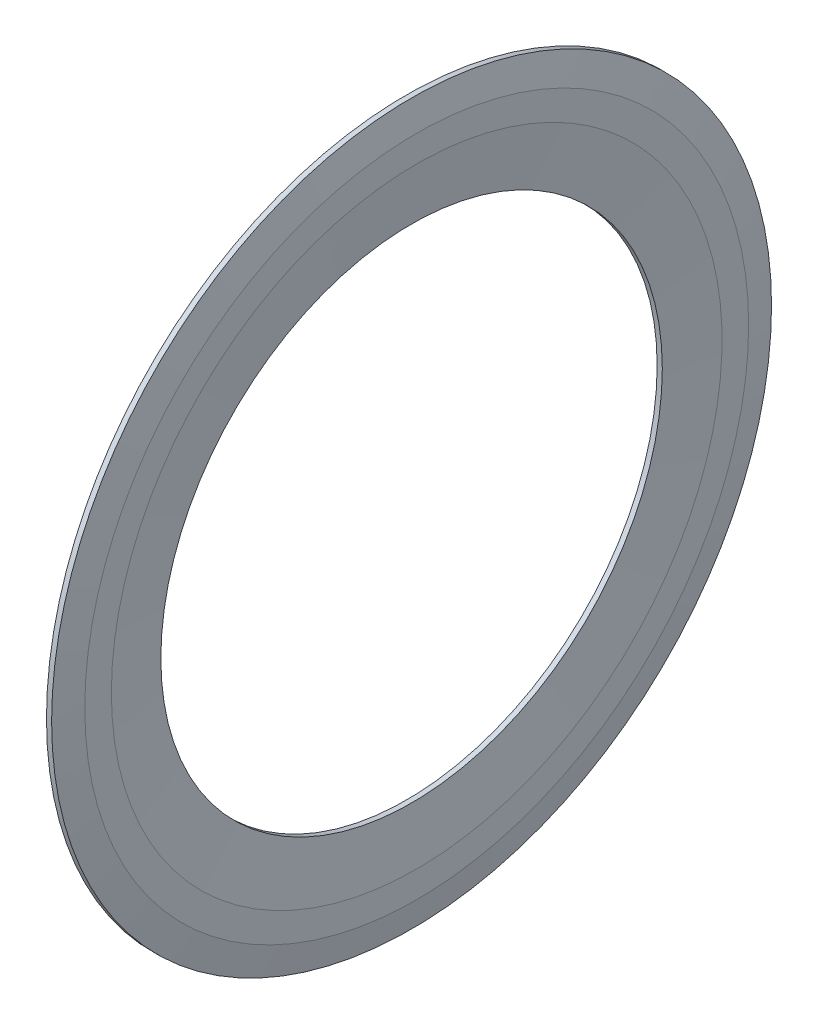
ISO-10303-21;
HEADER;
FILE_DESCRIPTION(('STEP AP214'),'2;1');
FILE_NAME('part.step','',(''),(''),'','','');
FILE_SCHEMA(('AUTOMOTIVE_DESIGN { 1 0 10303 214 1 1 1 1 }'));
ENDSEC;
DATA;
#1=APPLICATION_CONTEXT('core data for automotive mechanical design processes');
#2=APPLICATION_PROTOCOL_DEFINITION('international standard','automotive_design',2000,#1);
#3=PRODUCT_CONTEXT('',#1,'mechanical');
#4=PRODUCT('Part','Part','',(#3));
#5=PRODUCT_RELATED_PRODUCT_CATEGORY('part','',(#4));
#6=PRODUCT_DEFINITION_FORMATION('','',#4);
#7=PRODUCT_DEFINITION_CONTEXT('part definition',#1,'design');
#8=PRODUCT_DEFINITION('design','',#6,#7);
#9=PRODUCT_DEFINITION_SHAPE('','',#8);
#10=(LENGTH_UNIT() NAMED_UNIT(*) SI_UNIT(.MILLI.,.METRE.));
#11=(NAMED_UNIT(*) PLANE_ANGLE_UNIT() SI_UNIT($,.RADIAN.));
#12=(NAMED_UNIT(*) SI_UNIT($,.STERADIAN.) SOLID_ANGLE_UNIT());
#13=UNCERTAINTY_MEASURE_WITH_UNIT(LENGTH_MEASURE(1.E-05),#10,'distance_accuracy_value','');
#14=(GEOMETRIC_REPRESENTATION_CONTEXT(3) GLOBAL_UNCERTAINTY_ASSIGNED_CONTEXT((#13)) GLOBAL_UNIT_ASSIGNED_CONTEXT((#10,
#11,#12)) REPRESENTATION_CONTEXT('',''));
#15=CARTESIAN_POINT('',(0.,0.,0.));
#16=DIRECTION('',(0.,0.,1.));
#17=DIRECTION('',(1.,0.,0.));
#18=AXIS2_PLACEMENT_3D('',#15,#16,#17);
#19=CARTESIAN_POINT('',(0.310000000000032,6.15,0.));
#20=DIRECTION('',(1.,0.,0.));
#21=DIRECTION('',(0.,0.,-1.));
#22=AXIS2_PLACEMENT_3D('',#19,#20,#21);
#23=PLANE('',#22);
#24=CARTESIAN_POINT('',(0.310000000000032,0.,0.));
#25=DIRECTION('',(-1.,0.,0.));
#26=DIRECTION('',(0.,0.,1.));
#27=AXIS2_PLACEMENT_3D('',#24,#25,#26);
#28=CIRCLE('',#27,5.05);
#29=CARTESIAN_POINT('',(0.310000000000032,0.,5.05));
#30=VERTEX_POINT('',#29);
#31=EDGE_CURVE('E10',#30,#30,#28,.T.);
#32=ORIENTED_EDGE('',*,*,#31,.F.);
#33=EDGE_LOOP('',(#32));
#34=FACE_BOUND('',#33,.T.);
#35=CARTESIAN_POINT('',(0.310000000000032,0.,0.));
#36=DIRECTION('',(-1.,0.,0.));
#37=DIRECTION('',(0.,0.,1.));
#38=AXIS2_PLACEMENT_3D('',#35,#36,#37);
#39=CIRCLE('',#38,6.15);
#40=CARTESIAN_POINT('',(0.310000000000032,0.,6.15));
#41=VERTEX_POINT('',#40);
#42=EDGE_CURVE('E66',#41,#41,#39,.T.);
#43=ORIENTED_EDGE('',*,*,#42,.T.);
#44=EDGE_LOOP('',(#43));
#45=FACE_BOUND('',#44,.T.);
#46=ADVANCED_FACE('F38',(#34,#45),#23,.F.);
#47=CARTESIAN_POINT('',(0.413499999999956,0.,0.));
#48=DIRECTION('',(-1.,0.,0.));
#49=DIRECTION('',(0.,0.,1.));
#50=AXIS2_PLACEMENT_3D('',#47,#48,#49);
#51=CYLINDRICAL_SURFACE('',#50,5.05);
#52=CARTESIAN_POINT('',(0.413499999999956,0.,0.));
#53=DIRECTION('',(-1.,0.,0.));
#54=DIRECTION('',(0.,0.,1.));
#55=AXIS2_PLACEMENT_3D('',#52,#53,#54);
#56=CIRCLE('',#55,5.05);
#57=CARTESIAN_POINT('',(0.413499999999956,0.,5.05));
#58=VERTEX_POINT('',#57);
#59=EDGE_CURVE('E44',#58,#58,#56,.T.);
#60=ORIENTED_EDGE('',*,*,#59,.F.);
#61=EDGE_LOOP('',(#60));
#62=FACE_BOUND('',#61,.T.);
#63=ORIENTED_EDGE('',*,*,#31,.T.);
#64=EDGE_LOOP('',(#63));
#65=FACE_BOUND('',#64,.T.);
#66=ADVANCED_FACE('F103',(#62,#65),#51,.F.);
#67=CARTESIAN_POINT('',(0.413499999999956,0.,0.));
#68=DIRECTION('',(1.,0.,0.));
#69=DIRECTION('',(0.,0.,-1.));
#70=AXIS2_PLACEMENT_3D('',#67,#68,#69);
#71=CONICAL_SURFACE('',#70,5.05,1.47698161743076);
#72=CARTESIAN_POINT('',(0.51699999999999,0.,0.));
#73=DIRECTION('',(-1.,0.,0.));
#74=DIRECTION('',(0.,0.,1.));
#75=AXIS2_PLACEMENT_3D('',#72,#73,#74);
#76=CIRCLE('',#75,6.15);
#77=CARTESIAN_POINT('',(0.51699999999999,0.,6.15));
#78=VERTEX_POINT('',#77);
#79=EDGE_CURVE('E48',#78,#78,#76,.T.);
#80=ORIENTED_EDGE('',*,*,#79,.F.);
#81=EDGE_LOOP('',(#80));
#82=FACE_BOUND('',#81,.T.);
#83=ORIENTED_EDGE('',*,*,#59,.T.);
#84=EDGE_LOOP('',(#83));
#85=FACE_BOUND('',#84,.T.);
#86=ADVANCED_FACE('F98',(#82,#85),#71,.F.);
#87=CARTESIAN_POINT('',(0.51699999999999,6.15,0.));
#88=DIRECTION('',(-1.,0.,0.));
#89=DIRECTION('',(0.,0.,1.));
#90=AXIS2_PLACEMENT_3D('',#87,#88,#89);
#91=PLANE('',#90);
#92=CARTESIAN_POINT('',(0.51699999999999,0.,0.));
#93=DIRECTION('',(-1.,0.,0.));
#94=DIRECTION('',(0.,0.,1.));
#95=AXIS2_PLACEMENT_3D('',#92,#93,#94);
#96=CIRCLE('',#95,6.6853923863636);
#97=CARTESIAN_POINT('',(0.51699999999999,0.,6.6853923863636));
#98=VERTEX_POINT('',#97);
#99=EDGE_CURVE('E52',#98,#98,#96,.T.);
#100=ORIENTED_EDGE('',*,*,#99,.F.);
#101=EDGE_LOOP('',(#100));
#102=FACE_BOUND('',#101,.T.);
#103=ORIENTED_EDGE('',*,*,#79,.T.);
#104=EDGE_LOOP('',(#103));
#105=FACE_BOUND('',#104,.T.);
#106=ADVANCED_FACE('F92',(#102,#105),#91,.F.);
#107=CARTESIAN_POINT('',(0.51699999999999,0.,0.));
#108=DIRECTION('',(-1.,0.,0.));
#109=DIRECTION('',(0.,0.,1.));
#110=AXIS2_PLACEMENT_3D('',#107,#108,#109);
#111=CONICAL_SURFACE('',#110,6.6853923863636,1.38949607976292);
#112=CARTESIAN_POINT('',(0.413499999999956,0.,0.));
#113=DIRECTION('',(-1.,0.,0.));
#114=DIRECTION('',(0.,0.,1.));
#115=AXIS2_PLACEMENT_3D('',#112,#113,#114);
#116=CIRCLE('',#115,7.25);
#117=CARTESIAN_POINT('',(0.413499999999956,0.,7.25));
#118=VERTEX_POINT('',#117);
#119=EDGE_CURVE('E57',#118,#118,#116,.T.);
#120=ORIENTED_EDGE('',*,*,#119,.F.);
#121=EDGE_LOOP('',(#120));
#122=FACE_BOUND('',#121,.T.);
#123=ORIENTED_EDGE('',*,*,#99,.T.);
#124=EDGE_LOOP('',(#123));
#125=FACE_BOUND('',#124,.T.);
#126=ADVANCED_FACE('F86',(#122,#125),#111,.T.);
#127=CARTESIAN_POINT('',(0.413499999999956,0.,0.));
#128=DIRECTION('',(-1.,0.,0.));
#129=DIRECTION('',(0.,0.,1.));
#130=AXIS2_PLACEMENT_3D('',#127,#128,#129);
#131=CYLINDRICAL_SURFACE('',#130,7.25);
#132=CARTESIAN_POINT('',(0.310000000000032,0.,0.));
#133=DIRECTION('',(-1.,0.,0.));
#134=DIRECTION('',(0.,0.,1.));
#135=AXIS2_PLACEMENT_3D('',#132,#133,#134);
#136=CIRCLE('',#135,7.25);
#137=CARTESIAN_POINT('',(0.310000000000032,0.,7.25));
#138=VERTEX_POINT('',#137);
#139=EDGE_CURVE('E60',#138,#138,#136,.T.);
#140=ORIENTED_EDGE('',*,*,#139,.F.);
#141=EDGE_LOOP('',(#140));
#142=FACE_BOUND('',#141,.T.);
#143=ORIENTED_EDGE('',*,*,#119,.T.);
#144=EDGE_LOOP('',(#143));
#145=FACE_BOUND('',#144,.T.);
#146=ADVANCED_FACE('F80',(#142,#145),#131,.T.);
#147=CARTESIAN_POINT('',(0.310000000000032,0.,0.));
#148=DIRECTION('',(-1.,0.,0.));
#149=DIRECTION('',(0.,0.,1.));
#150=AXIS2_PLACEMENT_3D('',#147,#148,#149);
#151=CONICAL_SURFACE('',#150,7.25,1.47698161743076);
#152=CARTESIAN_POINT('',(0.36175000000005,0.,0.));
#153=DIRECTION('',(-1.,0.,0.));
#154=DIRECTION('',(0.,0.,1.));
#155=AXIS2_PLACEMENT_3D('',#152,#153,#154);
#156=CIRCLE('',#155,6.7);
#157=CARTESIAN_POINT('',(0.36175000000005,0.,6.7));
#158=VERTEX_POINT('',#157);
#159=EDGE_CURVE('E63',#158,#158,#156,.T.);
#160=ORIENTED_EDGE('',*,*,#159,.F.);
#161=EDGE_LOOP('',(#160));
#162=FACE_BOUND('',#161,.T.);
#163=ORIENTED_EDGE('',*,*,#139,.T.);
#164=EDGE_LOOP('',(#163));
#165=FACE_BOUND('',#164,.T.);
#166=ADVANCED_FACE('F74',(#162,#165),#151,.F.);
#167=CARTESIAN_POINT('',(0.36175000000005,0.,0.));
#168=DIRECTION('',(1.,0.,0.));
#169=DIRECTION('',(0.,0.,-1.));
#170=AXIS2_PLACEMENT_3D('',#167,#168,#169);
#171=CONICAL_SURFACE('',#170,6.7,1.47698161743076);
#172=ORIENTED_EDGE('',*,*,#42,.F.);
#173=EDGE_LOOP('',(#172));
#174=FACE_BOUND('',#173,.T.);
#175=ORIENTED_EDGE('',*,*,#159,.T.);
#176=EDGE_LOOP('',(#175));
#177=FACE_BOUND('',#176,.T.);
#178=ADVANCED_FACE('F71',(#174,#177),#171,.T.);
#179=CLOSED_SHELL('',(#46,#66,#86,#106,#126,#146,#166,#178));
#180=MANIFOLD_SOLID_BREP('B2',#179);
#181=ADVANCED_BREP_SHAPE_REPRESENTATION('',(#18,#180),#14);
#182=SHAPE_DEFINITION_REPRESENTATION(#9,#181);
ENDSEC;
END-ISO-10303-21;
